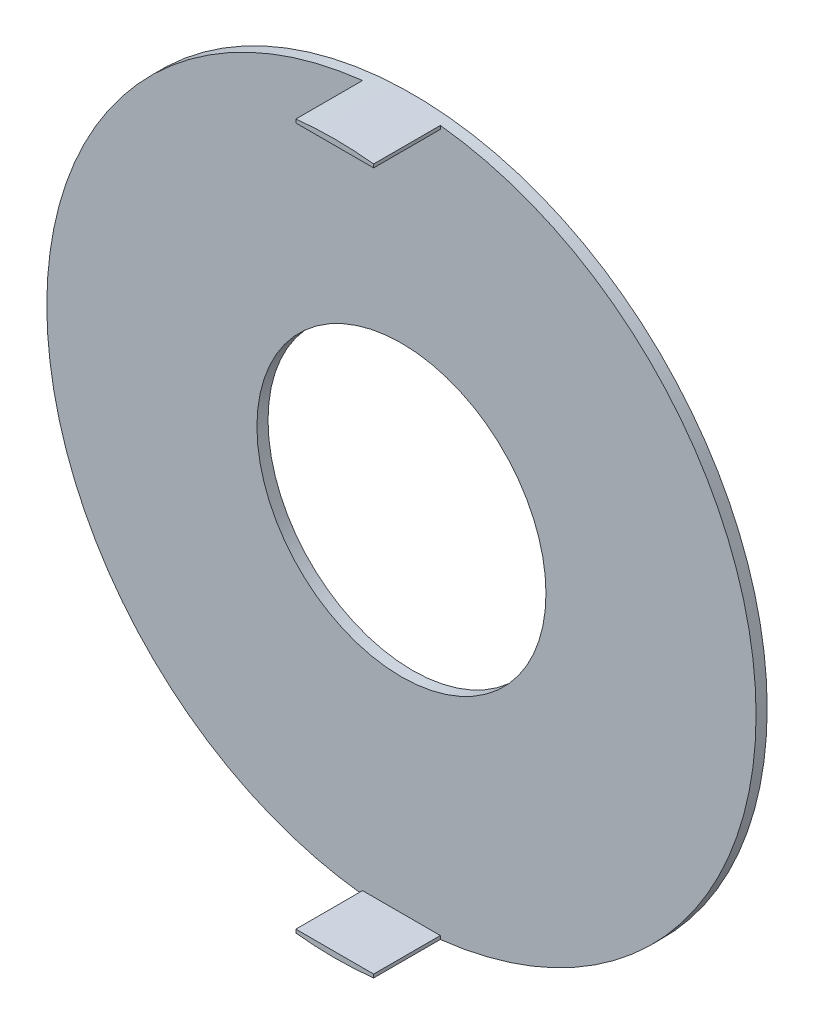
ISO-10303-21;
HEADER;
FILE_DESCRIPTION(('STEP AP214'),'2;1');
FILE_NAME('part.step','',(''),(''),'','','');
FILE_SCHEMA(('AUTOMOTIVE_DESIGN { 1 0 10303 214 1 1 1 1 }'));
ENDSEC;
DATA;
#1=APPLICATION_CONTEXT('core data for automotive mechanical design processes');
#2=APPLICATION_PROTOCOL_DEFINITION('international standard','automotive_design',2000,#1);
#3=PRODUCT_CONTEXT('',#1,'mechanical');
#4=PRODUCT('Part','Part','',(#3));
#5=PRODUCT_RELATED_PRODUCT_CATEGORY('part','',(#4));
#6=PRODUCT_DEFINITION_FORMATION('','',#4);
#7=PRODUCT_DEFINITION_CONTEXT('part definition',#1,'design');
#8=PRODUCT_DEFINITION('design','',#6,#7);
#9=PRODUCT_DEFINITION_SHAPE('','',#8);
#10=(LENGTH_UNIT() NAMED_UNIT(*) SI_UNIT(.MILLI.,.METRE.));
#11=(NAMED_UNIT(*) PLANE_ANGLE_UNIT() SI_UNIT($,.RADIAN.));
#12=(NAMED_UNIT(*) SI_UNIT($,.STERADIAN.) SOLID_ANGLE_UNIT());
#13=UNCERTAINTY_MEASURE_WITH_UNIT(LENGTH_MEASURE(1.E-05),#10,'distance_accuracy_value','');
#14=(GEOMETRIC_REPRESENTATION_CONTEXT(3) GLOBAL_UNCERTAINTY_ASSIGNED_CONTEXT((#13)) GLOBAL_UNIT_ASSIGNED_CONTEXT((#10,
#11,#12)) REPRESENTATION_CONTEXT('',''));
#15=CARTESIAN_POINT('',(0.,0.,0.));
#16=DIRECTION('',(0.,0.,1.));
#17=DIRECTION('',(1.,0.,0.));
#18=AXIS2_PLACEMENT_3D('',#15,#16,#17);
#19=CARTESIAN_POINT('',(0.,0.,0.5));
#20=DIRECTION('',(0.,0.,1.));
#21=DIRECTION('',(1.,0.,0.));
#22=AXIS2_PLACEMENT_3D('',#19,#20,#21);
#23=PLANE('',#22);
#24=CARTESIAN_POINT('',(0.,0.,0.5));
#25=DIRECTION('',(0.,0.,1.));
#26=DIRECTION('',(1.,0.,0.));
#27=AXIS2_PLACEMENT_3D('',#24,#25,#26);
#28=CIRCLE('',#27,6.5);
#29=CARTESIAN_POINT('',(6.5,0.,0.5));
#30=VERTEX_POINT('',#29);
#31=EDGE_CURVE('E147',#30,#30,#28,.T.);
#32=ORIENTED_EDGE('',*,*,#31,.F.);
#33=EDGE_LOOP('',(#32));
#34=FACE_BOUND('',#33,.T.);
#35=CARTESIAN_POINT('',(0.,0.,0.5));
#36=DIRECTION('',(0.,0.,1.));
#37=DIRECTION('',(1.,0.,0.));
#38=AXIS2_PLACEMENT_3D('',#35,#36,#37);
#39=CIRCLE('',#38,15.95);
#40=CARTESIAN_POINT('',(-1.75,15.853706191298,0.5));
#41=VERTEX_POINT('',#40);
#42=CARTESIAN_POINT('',(-1.75000000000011,-15.853706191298,0.5));
#43=VERTEX_POINT('',#42);
#44=EDGE_CURVE('E11',#41,#43,#39,.T.);
#45=ORIENTED_EDGE('',*,*,#44,.T.);
#46=DIRECTION('',(0.,-1.,0.));
#47=VECTOR('',#46,1.);
#48=CARTESIAN_POINT('',(-1.75000000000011,-15.853706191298,0.5));
#49=LINE('',#48,#47);
#50=CARTESIAN_POINT('',(-1.75000000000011,-15.7,0.5));
#51=VERTEX_POINT('',#50);
#52=EDGE_CURVE('E53',#51,#43,#49,.T.);
#53=ORIENTED_EDGE('',*,*,#52,.F.);
#54=DIRECTION('',(-1.,0.,0.));
#55=VECTOR('',#54,1.);
#56=CARTESIAN_POINT('',(1.74999999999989,-15.7,0.5));
#57=LINE('',#56,#55);
#58=CARTESIAN_POINT('',(1.74999999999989,-15.7,0.5));
#59=VERTEX_POINT('',#58);
#60=EDGE_CURVE('E49',#59,#51,#57,.T.);
#61=ORIENTED_EDGE('',*,*,#60,.F.);
#62=DIRECTION('',(0.,1.,0.));
#63=VECTOR('',#62,1.);
#64=CARTESIAN_POINT('',(1.74999999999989,-15.853706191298,0.5));
#65=LINE('',#64,#63);
#66=CARTESIAN_POINT('',(1.74999999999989,-15.853706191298,0.5));
#67=VERTEX_POINT('',#66);
#68=EDGE_CURVE('E106',#67,#59,#65,.T.);
#69=ORIENTED_EDGE('',*,*,#68,.F.);
#70=CARTESIAN_POINT('',(1.75,15.853706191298,0.5));
#71=VERTEX_POINT('',#70);
#72=EDGE_CURVE('E36',#67,#71,#39,.T.);
#73=ORIENTED_EDGE('',*,*,#72,.T.);
#74=DIRECTION('',(0.,1.,0.));
#75=VECTOR('',#74,1.);
#76=CARTESIAN_POINT('',(1.75,15.853706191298,0.5));
#77=LINE('',#76,#75);
#78=CARTESIAN_POINT('',(1.75,15.7,0.5));
#79=VERTEX_POINT('',#78);
#80=EDGE_CURVE('E117',#79,#71,#77,.T.);
#81=ORIENTED_EDGE('',*,*,#80,.F.);
#82=DIRECTION('',(1.,0.,0.));
#83=VECTOR('',#82,1.);
#84=CARTESIAN_POINT('',(-1.75,15.7,0.5));
#85=LINE('',#84,#83);
#86=CARTESIAN_POINT('',(-1.75,15.7,0.5));
#87=VERTEX_POINT('',#86);
#88=EDGE_CURVE('E125',#87,#79,#85,.T.);
#89=ORIENTED_EDGE('',*,*,#88,.F.);
#90=DIRECTION('',(0.,-1.,0.));
#91=VECTOR('',#90,1.);
#92=CARTESIAN_POINT('',(-1.75,15.853706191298,0.5));
#93=LINE('',#92,#91);
#94=EDGE_CURVE('E128',#41,#87,#93,.T.);
#95=ORIENTED_EDGE('',*,*,#94,.F.);
#96=EDGE_LOOP('',(#45,#53,#61,#69,#73,#81,#89,#95));
#97=FACE_BOUND('',#96,.T.);
#98=ADVANCED_FACE('F32',(#34,#97),#23,.T.);
#99=CARTESIAN_POINT('',(0.,0.,0.));
#100=DIRECTION('',(0.,0.,1.));
#101=DIRECTION('',(1.,0.,0.));
#102=AXIS2_PLACEMENT_3D('',#99,#100,#101);
#103=PLANE('',#102);
#104=CARTESIAN_POINT('',(0.,0.,0.));
#105=DIRECTION('',(0.,0.,1.));
#106=DIRECTION('',(1.,0.,0.));
#107=AXIS2_PLACEMENT_3D('',#104,#105,#106);
#108=CIRCLE('',#107,15.95);
#109=CARTESIAN_POINT('',(15.95,0.,0.));
#110=VERTEX_POINT('',#109);
#111=EDGE_CURVE('E105',#110,#110,#108,.T.);
#112=ORIENTED_EDGE('',*,*,#111,.F.);
#113=EDGE_LOOP('',(#112));
#114=FACE_BOUND('',#113,.T.);
#115=CARTESIAN_POINT('',(0.,0.,0.));
#116=DIRECTION('',(0.,0.,1.));
#117=DIRECTION('',(1.,0.,0.));
#118=AXIS2_PLACEMENT_3D('',#115,#116,#117);
#119=CIRCLE('',#118,6.5);
#120=CARTESIAN_POINT('',(6.5,0.,0.));
#121=VERTEX_POINT('',#120);
#122=EDGE_CURVE('E132',#121,#121,#119,.T.);
#123=ORIENTED_EDGE('',*,*,#122,.T.);
#124=EDGE_LOOP('',(#123));
#125=FACE_BOUND('',#124,.T.);
#126=ADVANCED_FACE('F187',(#114,#125),#103,.F.);
#127=CARTESIAN_POINT('',(0.,0.,0.5));
#128=DIRECTION('',(0.,0.,-1.));
#129=DIRECTION('',(-1.,0.,0.));
#130=AXIS2_PLACEMENT_3D('',#127,#128,#129);
#131=CYLINDRICAL_SURFACE('',#130,15.95);
#132=ORIENTED_EDGE('',*,*,#44,.F.);
#133=DIRECTION('',(0.,0.,-1.));
#134=VECTOR('',#133,1.);
#135=CARTESIAN_POINT('',(-1.75,15.853706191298,3.5));
#136=LINE('',#135,#134);
#137=CARTESIAN_POINT('',(-1.75,15.853706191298,3.5));
#138=VERTEX_POINT('',#137);
#139=EDGE_CURVE('E133',#138,#41,#136,.T.);
#140=ORIENTED_EDGE('',*,*,#139,.F.);
#141=CARTESIAN_POINT('',(0.,0.,3.5));
#142=DIRECTION('',(0.,0.,1.));
#143=DIRECTION('',(1.,0.,0.));
#144=AXIS2_PLACEMENT_3D('',#141,#142,#143);
#145=CIRCLE('',#144,15.95);
#146=CARTESIAN_POINT('',(1.75,15.853706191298,3.5));
#147=VERTEX_POINT('',#146);
#148=EDGE_CURVE('E161',#147,#138,#145,.T.);
#149=ORIENTED_EDGE('',*,*,#148,.F.);
#150=DIRECTION('',(0.,0.,-1.));
#151=VECTOR('',#150,1.);
#152=CARTESIAN_POINT('',(1.75,15.853706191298,3.5));
#153=LINE('',#152,#151);
#154=EDGE_CURVE('E103',#147,#71,#153,.T.);
#155=ORIENTED_EDGE('',*,*,#154,.T.);
#156=ORIENTED_EDGE('',*,*,#72,.F.);
#157=DIRECTION('',(0.,0.,-1.));
#158=VECTOR('',#157,1.);
#159=CARTESIAN_POINT('',(1.74999999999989,-15.853706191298,3.5));
#160=LINE('',#159,#158);
#161=CARTESIAN_POINT('',(1.74999999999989,-15.853706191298,3.5));
#162=VERTEX_POINT('',#161);
#163=EDGE_CURVE('E100',#162,#67,#160,.T.);
#164=ORIENTED_EDGE('',*,*,#163,.F.);
#165=CARTESIAN_POINT('',(0.,0.,3.5));
#166=DIRECTION('',(0.,0.,1.));
#167=DIRECTION('',(-1.,0.,0.));
#168=AXIS2_PLACEMENT_3D('',#165,#166,#167);
#169=CIRCLE('',#168,15.95);
#170=CARTESIAN_POINT('',(-1.75000000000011,-15.853706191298,3.5));
#171=VERTEX_POINT('',#170);
#172=EDGE_CURVE('E293',#171,#162,#169,.T.);
#173=ORIENTED_EDGE('',*,*,#172,.F.);
#174=DIRECTION('',(0.,0.,-1.));
#175=VECTOR('',#174,1.);
#176=CARTESIAN_POINT('',(-1.75000000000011,-15.853706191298,3.5));
#177=LINE('',#176,#175);
#178=EDGE_CURVE('E113',#171,#43,#177,.T.);
#179=ORIENTED_EDGE('',*,*,#178,.T.);
#180=EDGE_LOOP('',(#132,#140,#149,#155,#156,#164,#173,#179));
#181=FACE_BOUND('',#180,.T.);
#182=ORIENTED_EDGE('',*,*,#111,.T.);
#183=EDGE_LOOP('',(#182));
#184=FACE_BOUND('',#183,.T.);
#185=ADVANCED_FACE('F34',(#181,#184),#131,.T.);
#186=CARTESIAN_POINT('',(0.,0.,0.5));
#187=DIRECTION('',(0.,0.,-1.));
#188=DIRECTION('',(-1.,0.,0.));
#189=AXIS2_PLACEMENT_3D('',#186,#187,#188);
#190=CYLINDRICAL_SURFACE('',#189,6.5);
#191=ORIENTED_EDGE('',*,*,#31,.T.);
#192=EDGE_LOOP('',(#191));
#193=FACE_BOUND('',#192,.T.);
#194=ORIENTED_EDGE('',*,*,#122,.F.);
#195=EDGE_LOOP('',(#194));
#196=FACE_BOUND('',#195,.T.);
#197=ADVANCED_FACE('F176',(#193,#196),#190,.F.);
#198=CARTESIAN_POINT('',(1.75,15.853706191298,3.5));
#199=DIRECTION('',(-1.,0.,0.));
#200=DIRECTION('',(0.,-1.,0.));
#201=AXIS2_PLACEMENT_3D('',#198,#199,#200);
#202=PLANE('',#201);
#203=ORIENTED_EDGE('',*,*,#80,.T.);
#204=ORIENTED_EDGE('',*,*,#154,.F.);
#205=DIRECTION('',(0.,1.,0.));
#206=VECTOR('',#205,1.);
#207=CARTESIAN_POINT('',(1.75,15.853706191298,3.5));
#208=LINE('',#207,#206);
#209=CARTESIAN_POINT('',(1.75,15.7,3.5));
#210=VERTEX_POINT('',#209);
#211=EDGE_CURVE('E162',#210,#147,#208,.T.);
#212=ORIENTED_EDGE('',*,*,#211,.F.);
#213=DIRECTION('',(0.,0.,-1.));
#214=VECTOR('',#213,1.);
#215=CARTESIAN_POINT('',(1.75,15.7,3.5));
#216=LINE('',#215,#214);
#217=EDGE_CURVE('E154',#210,#79,#216,.T.);
#218=ORIENTED_EDGE('',*,*,#217,.T.);
#219=EDGE_LOOP('',(#203,#204,#212,#218));
#220=FACE_BOUND('',#219,.T.);
#221=ADVANCED_FACE('F173',(#220),#202,.F.);
#222=CARTESIAN_POINT('',(-1.75,15.853706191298,3.5));
#223=DIRECTION('',(1.,0.,0.));
#224=DIRECTION('',(0.,1.,0.));
#225=AXIS2_PLACEMENT_3D('',#222,#223,#224);
#226=PLANE('',#225);
#227=ORIENTED_EDGE('',*,*,#94,.T.);
#228=DIRECTION('',(0.,0.,-1.));
#229=VECTOR('',#228,1.);
#230=CARTESIAN_POINT('',(-1.75,15.7,3.5));
#231=LINE('',#230,#229);
#232=CARTESIAN_POINT('',(-1.75,15.7,3.5));
#233=VERTEX_POINT('',#232);
#234=EDGE_CURVE('E138',#233,#87,#231,.T.);
#235=ORIENTED_EDGE('',*,*,#234,.F.);
#236=DIRECTION('',(0.,-1.,0.));
#237=VECTOR('',#236,1.);
#238=CARTESIAN_POINT('',(-1.75,15.853706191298,3.5));
#239=LINE('',#238,#237);
#240=EDGE_CURVE('E159',#138,#233,#239,.T.);
#241=ORIENTED_EDGE('',*,*,#240,.F.);
#242=ORIENTED_EDGE('',*,*,#139,.T.);
#243=EDGE_LOOP('',(#227,#235,#241,#242));
#244=FACE_BOUND('',#243,.T.);
#245=ADVANCED_FACE('F175',(#244),#226,.F.);
#246=CARTESIAN_POINT('',(-1.75,15.7,3.5));
#247=DIRECTION('',(0.,1.,0.));
#248=DIRECTION('',(0.,0.,1.));
#249=AXIS2_PLACEMENT_3D('',#246,#247,#248);
#250=PLANE('',#249);
#251=ORIENTED_EDGE('',*,*,#88,.T.);
#252=ORIENTED_EDGE('',*,*,#217,.F.);
#253=DIRECTION('',(1.,0.,0.));
#254=VECTOR('',#253,1.);
#255=CARTESIAN_POINT('',(-1.75,15.7,3.5));
#256=LINE('',#255,#254);
#257=EDGE_CURVE('E157',#233,#210,#256,.T.);
#258=ORIENTED_EDGE('',*,*,#257,.F.);
#259=ORIENTED_EDGE('',*,*,#234,.T.);
#260=EDGE_LOOP('',(#251,#252,#258,#259));
#261=FACE_BOUND('',#260,.T.);
#262=ADVANCED_FACE('F169',(#261),#250,.F.);
#263=CARTESIAN_POINT('',(0.,0.,3.5));
#264=DIRECTION('',(0.,0.,1.));
#265=DIRECTION('',(1.,0.,0.));
#266=AXIS2_PLACEMENT_3D('',#263,#264,#265);
#267=PLANE('',#266);
#268=ORIENTED_EDGE('',*,*,#211,.T.);
#269=ORIENTED_EDGE('',*,*,#148,.T.);
#270=ORIENTED_EDGE('',*,*,#240,.T.);
#271=ORIENTED_EDGE('',*,*,#257,.T.);
#272=EDGE_LOOP('',(#268,#269,#270,#271));
#273=FACE_BOUND('',#272,.T.);
#274=ADVANCED_FACE('F232',(#273),#267,.T.);
#275=CARTESIAN_POINT('',(-1.75000000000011,-15.853706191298,3.5));
#276=DIRECTION('',(1.,0.,0.));
#277=DIRECTION('',(0.,1.,0.));
#278=AXIS2_PLACEMENT_3D('',#275,#276,#277);
#279=PLANE('',#278);
#280=ORIENTED_EDGE('',*,*,#52,.T.);
#281=ORIENTED_EDGE('',*,*,#178,.F.);
#282=DIRECTION('',(0.,-1.,0.));
#283=VECTOR('',#282,1.);
#284=CARTESIAN_POINT('',(-1.75000000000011,-15.853706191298,3.5));
#285=LINE('',#284,#283);
#286=CARTESIAN_POINT('',(-1.75000000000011,-15.7,3.5));
#287=VERTEX_POINT('',#286);
#288=EDGE_CURVE('E291',#287,#171,#285,.T.);
#289=ORIENTED_EDGE('',*,*,#288,.F.);
#290=DIRECTION('',(0.,0.,-1.));
#291=VECTOR('',#290,1.);
#292=CARTESIAN_POINT('',(-1.75000000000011,-15.7,3.5));
#293=LINE('',#292,#291);
#294=EDGE_CURVE('E119',#287,#51,#293,.T.);
#295=ORIENTED_EDGE('',*,*,#294,.T.);
#296=EDGE_LOOP('',(#280,#281,#289,#295));
#297=FACE_BOUND('',#296,.T.);
#298=ADVANCED_FACE('F240',(#297),#279,.F.);
#299=CARTESIAN_POINT('',(1.74999999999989,-15.853706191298,3.5));
#300=DIRECTION('',(-1.,0.,0.));
#301=DIRECTION('',(0.,-1.,0.));
#302=AXIS2_PLACEMENT_3D('',#299,#300,#301);
#303=PLANE('',#302);
#304=ORIENTED_EDGE('',*,*,#68,.T.);
#305=DIRECTION('',(0.,0.,-1.));
#306=VECTOR('',#305,1.);
#307=CARTESIAN_POINT('',(1.74999999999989,-15.7,3.5));
#308=LINE('',#307,#306);
#309=CARTESIAN_POINT('',(1.74999999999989,-15.7,3.5));
#310=VERTEX_POINT('',#309);
#311=EDGE_CURVE('E114',#310,#59,#308,.T.);
#312=ORIENTED_EDGE('',*,*,#311,.F.);
#313=DIRECTION('',(0.,1.,0.));
#314=VECTOR('',#313,1.);
#315=CARTESIAN_POINT('',(1.74999999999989,-15.853706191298,3.5));
#316=LINE('',#315,#314);
#317=EDGE_CURVE('E112',#162,#310,#316,.T.);
#318=ORIENTED_EDGE('',*,*,#317,.F.);
#319=ORIENTED_EDGE('',*,*,#163,.T.);
#320=EDGE_LOOP('',(#304,#312,#318,#319));
#321=FACE_BOUND('',#320,.T.);
#322=ADVANCED_FACE('F111',(#321),#303,.F.);
#323=CARTESIAN_POINT('',(1.74999999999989,-15.7,3.5));
#324=DIRECTION('',(0.,-1.,0.));
#325=DIRECTION('',(1.,0.,0.));
#326=AXIS2_PLACEMENT_3D('',#323,#324,#325);
#327=PLANE('',#326);
#328=ORIENTED_EDGE('',*,*,#60,.T.);
#329=ORIENTED_EDGE('',*,*,#294,.F.);
#330=DIRECTION('',(-1.,0.,0.));
#331=VECTOR('',#330,1.);
#332=CARTESIAN_POINT('',(1.74999999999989,-15.7,3.5));
#333=LINE('',#332,#331);
#334=EDGE_CURVE('E295',#310,#287,#333,.T.);
#335=ORIENTED_EDGE('',*,*,#334,.F.);
#336=ORIENTED_EDGE('',*,*,#311,.T.);
#337=EDGE_LOOP('',(#328,#329,#335,#336));
#338=FACE_BOUND('',#337,.T.);
#339=ADVANCED_FACE('F266',(#338),#327,.F.);
#340=CARTESIAN_POINT('',(0.,0.,3.5));
#341=DIRECTION('',(0.,0.,1.));
#342=DIRECTION('',(-1.,0.,0.));
#343=AXIS2_PLACEMENT_3D('',#340,#341,#342);
#344=PLANE('',#343);
#345=ORIENTED_EDGE('',*,*,#288,.T.);
#346=ORIENTED_EDGE('',*,*,#172,.T.);
#347=ORIENTED_EDGE('',*,*,#317,.T.);
#348=ORIENTED_EDGE('',*,*,#334,.T.);
#349=EDGE_LOOP('',(#345,#346,#347,#348));
#350=FACE_BOUND('',#349,.T.);
#351=ADVANCED_FACE('F274',(#350),#344,.T.);
#352=CLOSED_SHELL('',(#98,#126,#185,#197,#221,#245,#262,#274,#298,#322,#339,#351));
#353=MANIFOLD_SOLID_BREP('B2',#352);
#354=ADVANCED_BREP_SHAPE_REPRESENTATION('',(#18,#353),#14);
#355=SHAPE_DEFINITION_REPRESENTATION(#9,#354);
ENDSEC;
END-ISO-10303-21;
